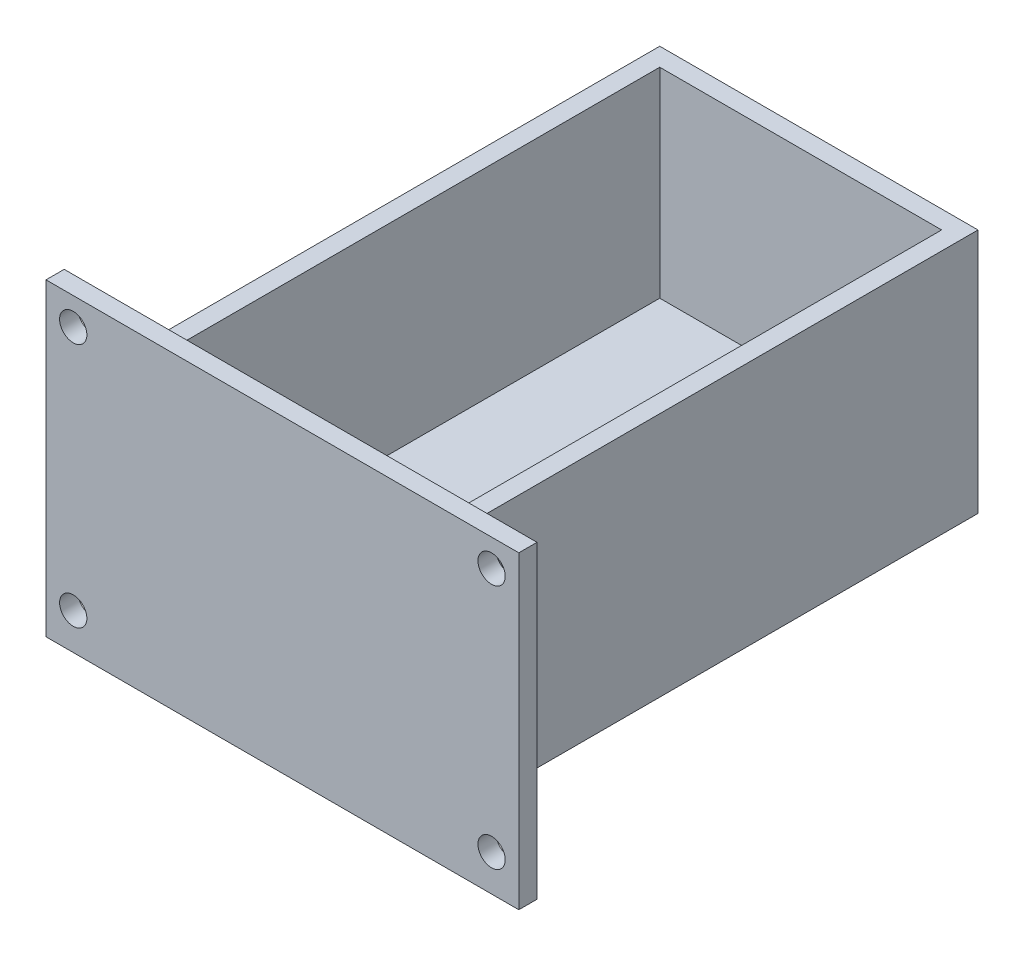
from build123d import *

# Parameters (mm, degrees)
SKETCH1_W           = 35
SKETCH1_H           = 30
BOSS_EXTRUDE1_DEPTH = 57
SKETCH2_W           = 52
SKETCH2_H           = 36
BOSS_EXTRUDE2_DEPTH = 2
SKETCH3_W           = 31
SKETCH3_H           = 53
CUT_EXTRUDE1_DEPTH  = 22
SKETCH5_W           = 35
SKETCH5_H           = 57
CUT_EXTRUDE3_DEPTH  = 3
SKETCH6_W           = 52
SKETCH6_H           = 2
CUT_EXTRUDE4_DEPTH  = 67.940271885
SKETCH9_W           = 52
SKETCH9_H           = 34
BOSS_EXTRUDE3_DEPTH = 2
SKETCH11_R          = 1.5
CUT_EXTRUDE6_DEPTH  = 27


with BuildPart() as part:
    # Sketch1 → Boss-Extrude1 (new body)
    with BuildSketch(Plane.XY):
        Rectangle(SKETCH1_W, SKETCH1_H)
    extrude(amount=-BOSS_EXTRUDE1_DEPTH)

    # Sketch2 → Boss-Extrude2 (add)
    with BuildSketch(Plane.XY):
        Rectangle(SKETCH2_W, SKETCH2_H)
    extrude(amount=BOSS_EXTRUDE2_DEPTH)

    # Sketch3 → Cut-Extrude1 (cut)
    with BuildSketch(Plane(origin=(0, 15, 0), x_dir=(1, 0, 0), z_dir=(0, 1, 0))):
        with Locations((0, 28.5)):
            Rectangle(SKETCH3_W, SKETCH3_H)
    extrude(amount=-CUT_EXTRUDE1_DEPTH, mode=Mode.SUBTRACT)

    # Sketch5 → Cut-Extrude3 (cut)
    with BuildSketch(Plane.XZ.offset(15)):
        with Locations((0, -28.5)):
            Rectangle(SKETCH5_W, SKETCH5_H)
    extrude(amount=-CUT_EXTRUDE3_DEPTH, mode=Mode.SUBTRACT)

    # Sketch6 → Cut-Extrude4 (cut, through all)
    with BuildSketch(Plane.XY.offset(2)):
        with Locations((0, -17)):
            Rectangle(SKETCH6_W, SKETCH6_H)
    extrude(amount=-CUT_EXTRUDE4_DEPTH, mode=Mode.SUBTRACT)

    # Sketch9 → Boss-Extrude3 (add)
    with BuildSketch(Plane.XY.offset(2)):
        with Locations((0, 1)):
            Rectangle(SKETCH9_W, SKETCH9_H)
    extrude(amount=-BOSS_EXTRUDE3_DEPTH)

    # Sketch11 → Cut-Extrude6 (cut)
    with BuildSketch(Plane.XY.offset(2)):
        with Locations((-23.004408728, 15)):
            Circle(SKETCH11_R)
        with Locations((-23.004408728, -12)):
            Circle(SKETCH11_R)
        with Locations((23.004408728, 15)):
            Circle(SKETCH11_R)
        with Locations((23.004408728, -12)):
            Circle(SKETCH11_R)
    extrude(amount=-CUT_EXTRUDE6_DEPTH, mode=Mode.SUBTRACT)


solid = part.part
